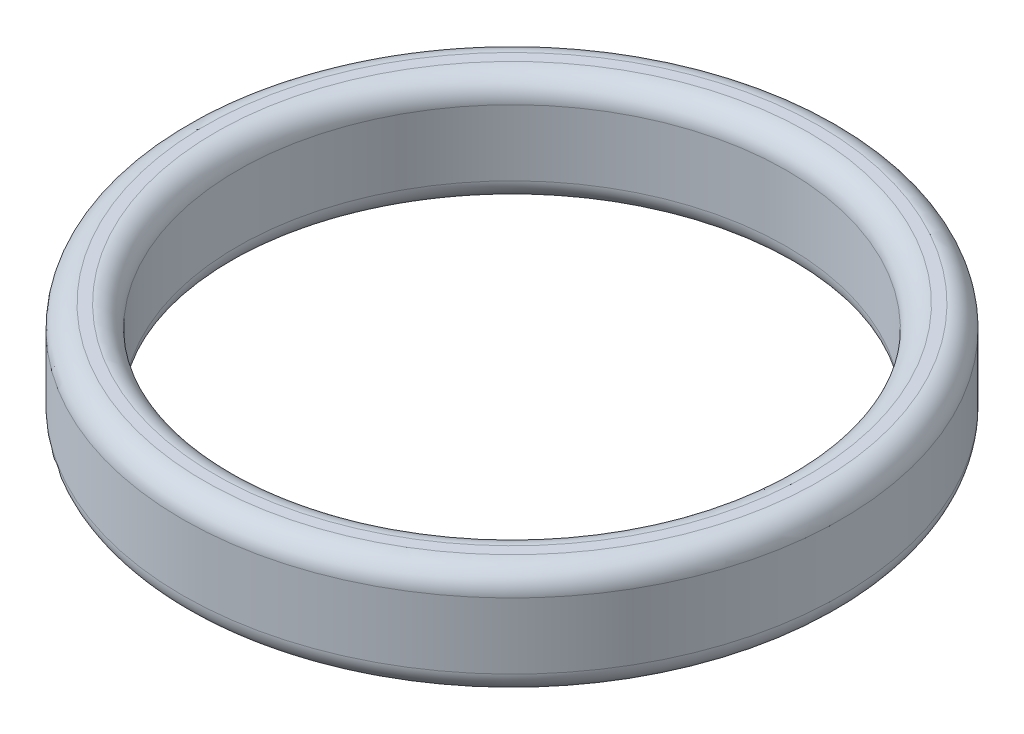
from build123d import *


with BuildPart() as part:
    # Esquisse1 → Base-R_volution (revolve)
    with BuildSketch(Plane.XY, mode=Mode.PRIVATE) as base_r_volution_sk:
        with BuildLine():
            Line((5, 2.1), (5, 0.9))
            ThreePointArc((5, 0.9), (5.117157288, 0.617157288), (5.4, 0.5))
            Line((5.4, 0.5), (5.6, 0.5))
            ThreePointArc((5.6, 0.5), (5.882842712, 0.617157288), (6, 0.9))
            Line((6, 0.9), (6, 2.1))
            ThreePointArc((6, 2.1), (5.882842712, 2.382842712), (5.6, 2.5))
            Line((5.6, 2.5), (5.4, 2.5))
            ThreePointArc((5.4, 2.5), (5.117157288, 2.382842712), (5, 2.1))
        make_face()
    revolve(base_r_volution_sk.sketch.rotate(Axis((0, 0, 0), (0, 1, 0)), 90), axis=Axis((0, 0, 0), (0, 1, 0)))


solid = part.part
